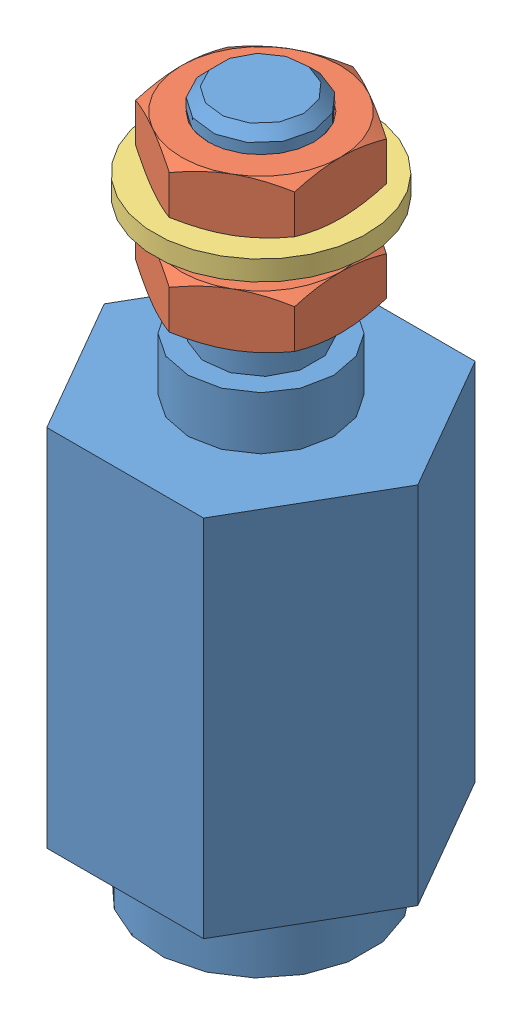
SolidWorks assembly 3333.sldasm, configuration Défaut (file format 8000). Lengths in mm.
Overall size (47.34 105 41).
4 component instances, 3 part files, 8 mates.
Components (placement in the parent):
- 3333-1: 3333.sldprt [Défaut] at origin size (47.34 105 41)
- 3173-1: 3173.sldprt [Défaut] at (0 79 0) x (0 0 -1) z (0 -1 0) size (27.71 24 8)
- 3173-3: 3173.sldprt [Défaut] at (0 94 0) x (0 0 -1) z (0 -1 0) size (27.71 24 8)
- 6046-1: 6046.sldprt [Défaut] at (0 91 0) x (-0.309549 0 -0.950884) z (0 1 0) size (32 32 3)
Mates (geometry in assembly coordinates):
- Coaxiale1: concentric anti-aligned: cylinder of 3333-1 through (0 105 0) axis (0 1 0) radius 8; cylinder of 3173-1 through (0 79 0) axis (0 -1 0) radius 7.188
- Distance1: distance = 18 mm aligned: plane of 3333-1; plane of 3173-1
- Parallèle1: parallel anti-aligned: plane of 3173-1; plane of assembly
- Coaxiale2: concentric anti-aligned: cylinder of 3333-1 through (0 105 0) axis (0 1 0) radius 8; cylinder of 3173-3 through (0 94 0) axis (0 -1 0) radius 7.188
- Distance2: distance = 7 mm anti-aligned: plane of 3173-1; plane of 3173-3
- Coïncidente2: coincident aligned: plane of 3173-1; plane of 3173-3
- Coaxiale3: concentric anti-aligned: cylinder of 3333-1 through (0 105 0) axis (0 1 0) radius 8; cylinder of 6046-1 through (0 94 0) axis (0 -1 0) radius 8.25
- Coïncidente3: coincident anti-aligned: plane of 3173-3; plane of 6046-1
